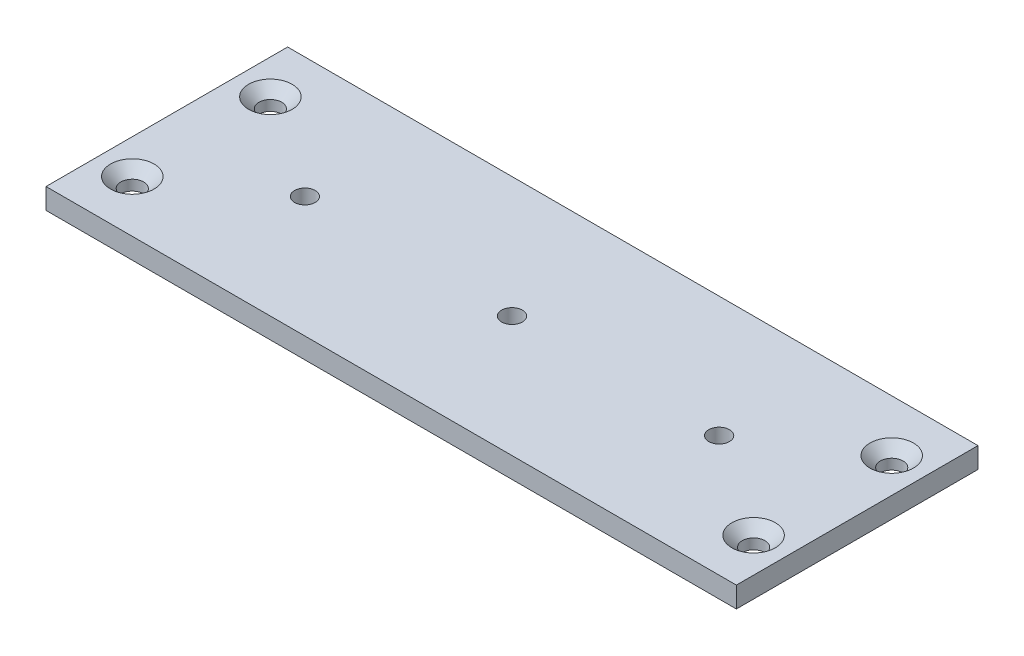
ISO-10303-21;
HEADER;
FILE_DESCRIPTION(('STEP AP214'),'2;1');
FILE_NAME('part.step','',(''),(''),'','','');
FILE_SCHEMA(('AUTOMOTIVE_DESIGN { 1 0 10303 214 1 1 1 1 }'));
ENDSEC;
DATA;
#1=APPLICATION_CONTEXT('core data for automotive mechanical design processes');
#2=APPLICATION_PROTOCOL_DEFINITION('international standard','automotive_design',2000,#1);
#3=PRODUCT_CONTEXT('',#1,'mechanical');
#4=PRODUCT('Part','Part','',(#3));
#5=PRODUCT_RELATED_PRODUCT_CATEGORY('part','',(#4));
#6=PRODUCT_DEFINITION_FORMATION('','',#4);
#7=PRODUCT_DEFINITION_CONTEXT('part definition',#1,'design');
#8=PRODUCT_DEFINITION('design','',#6,#7);
#9=PRODUCT_DEFINITION_SHAPE('','',#8);
#10=(LENGTH_UNIT() NAMED_UNIT(*) SI_UNIT(.MILLI.,.METRE.));
#11=(NAMED_UNIT(*) PLANE_ANGLE_UNIT() SI_UNIT($,.RADIAN.));
#12=(NAMED_UNIT(*) SI_UNIT($,.STERADIAN.) SOLID_ANGLE_UNIT());
#13=UNCERTAINTY_MEASURE_WITH_UNIT(LENGTH_MEASURE(1.E-05),#10,'distance_accuracy_value','');
#14=(GEOMETRIC_REPRESENTATION_CONTEXT(3) GLOBAL_UNCERTAINTY_ASSIGNED_CONTEXT((#13)) GLOBAL_UNIT_ASSIGNED_CONTEXT((#10,
#11,#12)) REPRESENTATION_CONTEXT('',''));
#15=CARTESIAN_POINT('',(0.,0.,0.));
#16=DIRECTION('',(0.,0.,1.));
#17=DIRECTION('',(1.,0.,0.));
#18=AXIS2_PLACEMENT_3D('',#15,#16,#17);
#19=CARTESIAN_POINT('',(0.,0.,-70.));
#20=DIRECTION('',(0.,-1.,0.));
#21=DIRECTION('',(0.,0.,-1.));
#22=AXIS2_PLACEMENT_3D('',#19,#20,#21);
#23=PLANE('',#22);
#24=CARTESIAN_POINT('',(10.,0.,-15.));
#25=DIRECTION('',(0.,1.,0.));
#26=DIRECTION('',(0.,0.,1.));
#27=AXIS2_PLACEMENT_3D('',#24,#25,#26);
#28=CIRCLE('',#27,3.3);
#29=CARTESIAN_POINT('',(10.,0.,-11.7));
#30=VERTEX_POINT('',#29);
#31=EDGE_CURVE('E143',#30,#30,#28,.T.);
#32=ORIENTED_EDGE('',*,*,#31,.T.);
#33=EDGE_LOOP('',(#32));
#34=FACE_BOUND('',#33,.T.);
#35=DIRECTION('',(0.,0.,1.));
#36=VECTOR('',#35,1.);
#37=CARTESIAN_POINT('',(0.,0.,0.));
#38=LINE('',#37,#36);
#39=CARTESIAN_POINT('',(0.,0.,-70.));
#40=VERTEX_POINT('',#39);
#41=CARTESIAN_POINT('',(0.,0.,0.));
#42=VERTEX_POINT('',#41);
#43=EDGE_CURVE('E94',#40,#42,#38,.T.);
#44=ORIENTED_EDGE('',*,*,#43,.F.);
#45=DIRECTION('',(-1.,0.,0.));
#46=VECTOR('',#45,1.);
#47=CARTESIAN_POINT('',(0.,0.,-70.));
#48=LINE('',#47,#46);
#49=CARTESIAN_POINT('',(200.,0.,-70.));
#50=VERTEX_POINT('',#49);
#51=EDGE_CURVE('E70',#50,#40,#48,.T.);
#52=ORIENTED_EDGE('',*,*,#51,.F.);
#53=DIRECTION('',(0.,0.,-1.));
#54=VECTOR('',#53,1.);
#55=CARTESIAN_POINT('',(200.,0.,0.));
#56=LINE('',#55,#54);
#57=CARTESIAN_POINT('',(200.,0.,0.));
#58=VERTEX_POINT('',#57);
#59=EDGE_CURVE('E64',#58,#50,#56,.T.);
#60=ORIENTED_EDGE('',*,*,#59,.F.);
#61=DIRECTION('',(1.,0.,0.));
#62=VECTOR('',#61,1.);
#63=CARTESIAN_POINT('',(0.,0.,0.));
#64=LINE('',#63,#62);
#65=EDGE_CURVE('E86',#42,#58,#64,.T.);
#66=ORIENTED_EDGE('',*,*,#65,.F.);
#67=EDGE_LOOP('',(#44,#52,#60,#66));
#68=FACE_BOUND('',#67,.T.);
#69=CARTESIAN_POINT('',(100.,0.,-35.));
#70=DIRECTION('',(0.,1.,0.));
#71=DIRECTION('',(0.,0.,1.));
#72=AXIS2_PLACEMENT_3D('',#69,#70,#71);
#73=CIRCLE('',#72,3.00000000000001);
#74=CARTESIAN_POINT('',(100.,0.,-32.));
#75=VERTEX_POINT('',#74);
#76=EDGE_CURVE('E97',#75,#75,#73,.T.);
#77=ORIENTED_EDGE('',*,*,#76,.T.);
#78=EDGE_LOOP('',(#77));
#79=FACE_BOUND('',#78,.T.);
#80=CARTESIAN_POINT('',(40.,0.,-35.));
#81=DIRECTION('',(0.,1.,0.));
#82=DIRECTION('',(0.,0.,1.));
#83=AXIS2_PLACEMENT_3D('',#80,#81,#82);
#84=CIRCLE('',#83,3.);
#85=CARTESIAN_POINT('',(40.,0.,-32.));
#86=VERTEX_POINT('',#85);
#87=EDGE_CURVE('E111',#86,#86,#84,.T.);
#88=ORIENTED_EDGE('',*,*,#87,.T.);
#89=EDGE_LOOP('',(#88));
#90=FACE_BOUND('',#89,.T.);
#91=CARTESIAN_POINT('',(160.,0.,-35.));
#92=DIRECTION('',(0.,1.,0.));
#93=DIRECTION('',(0.,0.,1.));
#94=AXIS2_PLACEMENT_3D('',#91,#92,#93);
#95=CIRCLE('',#94,2.99999999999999);
#96=CARTESIAN_POINT('',(160.,0.,-32.));
#97=VERTEX_POINT('',#96);
#98=EDGE_CURVE('E117',#97,#97,#95,.T.);
#99=ORIENTED_EDGE('',*,*,#98,.T.);
#100=EDGE_LOOP('',(#99));
#101=FACE_BOUND('',#100,.T.);
#102=CARTESIAN_POINT('',(190.,0.,-15.));
#103=DIRECTION('',(0.,1.,0.));
#104=DIRECTION('',(0.,0.,1.));
#105=AXIS2_PLACEMENT_3D('',#102,#103,#104);
#106=CIRCLE('',#105,3.3);
#107=CARTESIAN_POINT('',(190.,0.,-11.7));
#108=VERTEX_POINT('',#107);
#109=EDGE_CURVE('E123',#108,#108,#106,.T.);
#110=ORIENTED_EDGE('',*,*,#109,.T.);
#111=EDGE_LOOP('',(#110));
#112=FACE_BOUND('',#111,.T.);
#113=CARTESIAN_POINT('',(190.,0.,-55.));
#114=DIRECTION('',(0.,1.,0.));
#115=DIRECTION('',(0.,0.,1.));
#116=AXIS2_PLACEMENT_3D('',#113,#114,#115);
#117=CIRCLE('',#116,3.3);
#118=CARTESIAN_POINT('',(190.,0.,-51.7));
#119=VERTEX_POINT('',#118);
#120=EDGE_CURVE('E134',#119,#119,#117,.T.);
#121=ORIENTED_EDGE('',*,*,#120,.T.);
#122=EDGE_LOOP('',(#121));
#123=FACE_BOUND('',#122,.T.);
#124=CARTESIAN_POINT('',(10.,0.,-55.));
#125=DIRECTION('',(0.,1.,0.));
#126=DIRECTION('',(0.,0.,1.));
#127=AXIS2_PLACEMENT_3D('',#124,#125,#126);
#128=CIRCLE('',#127,3.3);
#129=CARTESIAN_POINT('',(10.,0.,-51.7));
#130=VERTEX_POINT('',#129);
#131=EDGE_CURVE('E152',#130,#130,#128,.T.);
#132=ORIENTED_EDGE('',*,*,#131,.T.);
#133=EDGE_LOOP('',(#132));
#134=FACE_BOUND('',#133,.T.);
#135=ADVANCED_FACE('F30',(#34,#68,#79,#90,#101,#112,#123,#134),#23,.T.);
#136=CARTESIAN_POINT('',(0.,6.,0.));
#137=DIRECTION('',(1.,0.,0.));
#138=DIRECTION('',(0.,0.,-1.));
#139=AXIS2_PLACEMENT_3D('',#136,#137,#138);
#140=PLANE('',#139);
#141=ORIENTED_EDGE('',*,*,#43,.T.);
#142=DIRECTION('',(0.,-1.,0.));
#143=VECTOR('',#142,1.);
#144=CARTESIAN_POINT('',(0.,6.,0.));
#145=LINE('',#144,#143);
#146=CARTESIAN_POINT('',(0.,6.,0.));
#147=VERTEX_POINT('',#146);
#148=EDGE_CURVE('E11',#147,#42,#145,.T.);
#149=ORIENTED_EDGE('',*,*,#148,.F.);
#150=DIRECTION('',(0.,0.,1.));
#151=VECTOR('',#150,1.);
#152=CARTESIAN_POINT('',(0.,6.,0.));
#153=LINE('',#152,#151);
#154=CARTESIAN_POINT('',(0.,6.,-70.));
#155=VERTEX_POINT('',#154);
#156=EDGE_CURVE('E82',#155,#147,#153,.T.);
#157=ORIENTED_EDGE('',*,*,#156,.F.);
#158=DIRECTION('',(0.,-1.,0.));
#159=VECTOR('',#158,1.);
#160=CARTESIAN_POINT('',(0.,6.,-70.));
#161=LINE('',#160,#159);
#162=EDGE_CURVE('E90',#155,#40,#161,.T.);
#163=ORIENTED_EDGE('',*,*,#162,.T.);
#164=EDGE_LOOP('',(#141,#149,#157,#163));
#165=FACE_BOUND('',#164,.T.);
#166=ADVANCED_FACE('F32',(#165),#140,.F.);
#167=CARTESIAN_POINT('',(0.,6.,0.));
#168=DIRECTION('',(0.,0.,-1.));
#169=DIRECTION('',(-1.,0.,0.));
#170=AXIS2_PLACEMENT_3D('',#167,#168,#169);
#171=PLANE('',#170);
#172=ORIENTED_EDGE('',*,*,#65,.T.);
#173=DIRECTION('',(0.,-1.,0.));
#174=VECTOR('',#173,1.);
#175=CARTESIAN_POINT('',(200.,6.,0.));
#176=LINE('',#175,#174);
#177=CARTESIAN_POINT('',(200.,6.,0.));
#178=VERTEX_POINT('',#177);
#179=EDGE_CURVE('E39',#178,#58,#176,.T.);
#180=ORIENTED_EDGE('',*,*,#179,.F.);
#181=DIRECTION('',(1.,0.,0.));
#182=VECTOR('',#181,1.);
#183=CARTESIAN_POINT('',(0.,6.,0.));
#184=LINE('',#183,#182);
#185=EDGE_CURVE('E77',#147,#178,#184,.T.);
#186=ORIENTED_EDGE('',*,*,#185,.F.);
#187=ORIENTED_EDGE('',*,*,#148,.T.);
#188=EDGE_LOOP('',(#172,#180,#186,#187));
#189=FACE_BOUND('',#188,.T.);
#190=ADVANCED_FACE('F85',(#189),#171,.F.);
#191=CARTESIAN_POINT('',(200.,6.,0.));
#192=DIRECTION('',(-1.,0.,0.));
#193=DIRECTION('',(0.,0.,1.));
#194=AXIS2_PLACEMENT_3D('',#191,#192,#193);
#195=PLANE('',#194);
#196=ORIENTED_EDGE('',*,*,#59,.T.);
#197=DIRECTION('',(0.,-1.,0.));
#198=VECTOR('',#197,1.);
#199=CARTESIAN_POINT('',(200.,6.,-70.));
#200=LINE('',#199,#198);
#201=CARTESIAN_POINT('',(200.,6.,-70.));
#202=VERTEX_POINT('',#201);
#203=EDGE_CURVE('E87',#202,#50,#200,.T.);
#204=ORIENTED_EDGE('',*,*,#203,.F.);
#205=DIRECTION('',(0.,0.,-1.));
#206=VECTOR('',#205,1.);
#207=CARTESIAN_POINT('',(200.,6.,0.));
#208=LINE('',#207,#206);
#209=EDGE_CURVE('E80',#178,#202,#208,.T.);
#210=ORIENTED_EDGE('',*,*,#209,.F.);
#211=ORIENTED_EDGE('',*,*,#179,.T.);
#212=EDGE_LOOP('',(#196,#204,#210,#211));
#213=FACE_BOUND('',#212,.T.);
#214=ADVANCED_FACE('F88',(#213),#195,.F.);
#215=CARTESIAN_POINT('',(0.,6.,-70.));
#216=DIRECTION('',(0.,0.,1.));
#217=DIRECTION('',(1.,0.,0.));
#218=AXIS2_PLACEMENT_3D('',#215,#216,#217);
#219=PLANE('',#218);
#220=ORIENTED_EDGE('',*,*,#51,.T.);
#221=ORIENTED_EDGE('',*,*,#162,.F.);
#222=DIRECTION('',(-1.,0.,0.));
#223=VECTOR('',#222,1.);
#224=CARTESIAN_POINT('',(0.,6.,-70.));
#225=LINE('',#224,#223);
#226=EDGE_CURVE('E47',#202,#155,#225,.T.);
#227=ORIENTED_EDGE('',*,*,#226,.F.);
#228=ORIENTED_EDGE('',*,*,#203,.T.);
#229=EDGE_LOOP('',(#220,#221,#227,#228));
#230=FACE_BOUND('',#229,.T.);
#231=ADVANCED_FACE('F102',(#230),#219,.F.);
#232=CARTESIAN_POINT('',(0.,6.,-70.));
#233=DIRECTION('',(0.,-1.,0.));
#234=DIRECTION('',(0.,0.,-1.));
#235=AXIS2_PLACEMENT_3D('',#232,#233,#234);
#236=PLANE('',#235);
#237=CARTESIAN_POINT('',(10.,6.,-55.));
#238=DIRECTION('',(0.,1.,0.));
#239=DIRECTION('',(0.,0.,1.));
#240=AXIS2_PLACEMENT_3D('',#237,#238,#239);
#241=CIRCLE('',#240,6.3);
#242=CARTESIAN_POINT('',(10.,6.,-48.7));
#243=VERTEX_POINT('',#242);
#244=EDGE_CURVE('E158',#243,#243,#241,.T.);
#245=ORIENTED_EDGE('',*,*,#244,.F.);
#246=EDGE_LOOP('',(#245));
#247=FACE_BOUND('',#246,.T.);
#248=CARTESIAN_POINT('',(10.,6.,-15.));
#249=DIRECTION('',(0.,1.,0.));
#250=DIRECTION('',(0.,0.,1.));
#251=AXIS2_PLACEMENT_3D('',#248,#249,#250);
#252=CIRCLE('',#251,6.3);
#253=CARTESIAN_POINT('',(10.,6.,-8.7));
#254=VERTEX_POINT('',#253);
#255=EDGE_CURVE('E149',#254,#254,#252,.T.);
#256=ORIENTED_EDGE('',*,*,#255,.F.);
#257=EDGE_LOOP('',(#256));
#258=FACE_BOUND('',#257,.T.);
#259=CARTESIAN_POINT('',(190.,6.,-55.));
#260=DIRECTION('',(0.,1.,0.));
#261=DIRECTION('',(0.,0.,1.));
#262=AXIS2_PLACEMENT_3D('',#259,#260,#261);
#263=CIRCLE('',#262,6.3);
#264=CARTESIAN_POINT('',(190.,6.,-48.7));
#265=VERTEX_POINT('',#264);
#266=EDGE_CURVE('E140',#265,#265,#263,.T.);
#267=ORIENTED_EDGE('',*,*,#266,.F.);
#268=EDGE_LOOP('',(#267));
#269=FACE_BOUND('',#268,.T.);
#270=CARTESIAN_POINT('',(190.,6.,-15.));
#271=DIRECTION('',(0.,1.,0.));
#272=DIRECTION('',(0.,0.,1.));
#273=AXIS2_PLACEMENT_3D('',#270,#271,#272);
#274=CIRCLE('',#273,6.3);
#275=CARTESIAN_POINT('',(190.,6.,-8.70000000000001));
#276=VERTEX_POINT('',#275);
#277=EDGE_CURVE('E131',#276,#276,#274,.T.);
#278=ORIENTED_EDGE('',*,*,#277,.F.);
#279=EDGE_LOOP('',(#278));
#280=FACE_BOUND('',#279,.T.);
#281=CARTESIAN_POINT('',(160.,6.,-35.));
#282=DIRECTION('',(0.,1.,0.));
#283=DIRECTION('',(0.,0.,1.));
#284=AXIS2_PLACEMENT_3D('',#281,#282,#283);
#285=CIRCLE('',#284,2.99999999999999);
#286=CARTESIAN_POINT('',(160.,6.,-32.));
#287=VERTEX_POINT('',#286);
#288=EDGE_CURVE('E120',#287,#287,#285,.T.);
#289=ORIENTED_EDGE('',*,*,#288,.F.);
#290=EDGE_LOOP('',(#289));
#291=FACE_BOUND('',#290,.T.);
#292=CARTESIAN_POINT('',(40.,6.,-35.));
#293=DIRECTION('',(0.,1.,0.));
#294=DIRECTION('',(0.,0.,1.));
#295=AXIS2_PLACEMENT_3D('',#292,#293,#294);
#296=CIRCLE('',#295,3.);
#297=CARTESIAN_POINT('',(40.,6.,-32.));
#298=VERTEX_POINT('',#297);
#299=EDGE_CURVE('E114',#298,#298,#296,.T.);
#300=ORIENTED_EDGE('',*,*,#299,.F.);
#301=EDGE_LOOP('',(#300));
#302=FACE_BOUND('',#301,.T.);
#303=CARTESIAN_POINT('',(100.,6.,-35.));
#304=DIRECTION('',(0.,1.,0.));
#305=DIRECTION('',(0.,0.,1.));
#306=AXIS2_PLACEMENT_3D('',#303,#304,#305);
#307=CIRCLE('',#306,3.00000000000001);
#308=CARTESIAN_POINT('',(100.,6.,-32.));
#309=VERTEX_POINT('',#308);
#310=EDGE_CURVE('E108',#309,#309,#307,.T.);
#311=ORIENTED_EDGE('',*,*,#310,.F.);
#312=EDGE_LOOP('',(#311));
#313=FACE_BOUND('',#312,.T.);
#314=ORIENTED_EDGE('',*,*,#156,.T.);
#315=ORIENTED_EDGE('',*,*,#185,.T.);
#316=ORIENTED_EDGE('',*,*,#209,.T.);
#317=ORIENTED_EDGE('',*,*,#226,.T.);
#318=EDGE_LOOP('',(#314,#315,#316,#317));
#319=FACE_BOUND('',#318,.T.);
#320=ADVANCED_FACE('F78',(#247,#258,#269,#280,#291,#302,#313,#319),#236,.F.);
#321=CARTESIAN_POINT('',(100.,0.,-35.));
#322=DIRECTION('',(0.,1.,0.));
#323=DIRECTION('',(0.,0.,1.));
#324=AXIS2_PLACEMENT_3D('',#321,#322,#323);
#325=CYLINDRICAL_SURFACE('',#324,3.00000000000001);
#326=ORIENTED_EDGE('',*,*,#76,.F.);
#327=EDGE_LOOP('',(#326));
#328=FACE_BOUND('',#327,.T.);
#329=ORIENTED_EDGE('',*,*,#310,.T.);
#330=EDGE_LOOP('',(#329));
#331=FACE_BOUND('',#330,.T.);
#332=ADVANCED_FACE('F166',(#328,#331),#325,.F.);
#333=CARTESIAN_POINT('',(40.,0.,-35.));
#334=DIRECTION('',(0.,1.,0.));
#335=DIRECTION('',(0.,0.,1.));
#336=AXIS2_PLACEMENT_3D('',#333,#334,#335);
#337=CYLINDRICAL_SURFACE('',#336,3.);
#338=ORIENTED_EDGE('',*,*,#87,.F.);
#339=EDGE_LOOP('',(#338));
#340=FACE_BOUND('',#339,.T.);
#341=ORIENTED_EDGE('',*,*,#299,.T.);
#342=EDGE_LOOP('',(#341));
#343=FACE_BOUND('',#342,.T.);
#344=ADVANCED_FACE('F181',(#340,#343),#337,.F.);
#345=CARTESIAN_POINT('',(160.,0.,-35.));
#346=DIRECTION('',(0.,1.,0.));
#347=DIRECTION('',(0.,0.,1.));
#348=AXIS2_PLACEMENT_3D('',#345,#346,#347);
#349=CYLINDRICAL_SURFACE('',#348,2.99999999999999);
#350=ORIENTED_EDGE('',*,*,#98,.F.);
#351=EDGE_LOOP('',(#350));
#352=FACE_BOUND('',#351,.T.);
#353=ORIENTED_EDGE('',*,*,#288,.T.);
#354=EDGE_LOOP('',(#353));
#355=FACE_BOUND('',#354,.T.);
#356=ADVANCED_FACE('F187',(#352,#355),#349,.F.);
#357=CARTESIAN_POINT('',(190.,6.,-15.));
#358=DIRECTION('',(0.,1.,0.));
#359=DIRECTION('',(0.,0.,1.));
#360=AXIS2_PLACEMENT_3D('',#357,#358,#359);
#361=CYLINDRICAL_SURFACE('',#360,3.3);
#362=ORIENTED_EDGE('',*,*,#109,.F.);
#363=EDGE_LOOP('',(#362));
#364=FACE_BOUND('',#363,.T.);
#365=CARTESIAN_POINT('',(190.,3.,-15.));
#366=DIRECTION('',(0.,1.,0.));
#367=DIRECTION('',(0.,0.,1.));
#368=AXIS2_PLACEMENT_3D('',#365,#366,#367);
#369=CIRCLE('',#368,3.3);
#370=CARTESIAN_POINT('',(190.,3.,-11.7));
#371=VERTEX_POINT('',#370);
#372=EDGE_CURVE('E128',#371,#371,#369,.T.);
#373=ORIENTED_EDGE('',*,*,#372,.T.);
#374=EDGE_LOOP('',(#373));
#375=FACE_BOUND('',#374,.T.);
#376=ADVANCED_FACE('F227',(#364,#375),#361,.F.);
#377=CARTESIAN_POINT('',(190.,6.,-15.));
#378=DIRECTION('',(0.,1.,0.));
#379=DIRECTION('',(0.,0.,1.));
#380=AXIS2_PLACEMENT_3D('',#377,#378,#379);
#381=CONICAL_SURFACE('',#380,6.3,0.785398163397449);
#382=ORIENTED_EDGE('',*,*,#372,.F.);
#383=EDGE_LOOP('',(#382));
#384=FACE_BOUND('',#383,.T.);
#385=ORIENTED_EDGE('',*,*,#277,.T.);
#386=EDGE_LOOP('',(#385));
#387=FACE_BOUND('',#386,.T.);
#388=ADVANCED_FACE('F232',(#384,#387),#381,.F.);
#389=CARTESIAN_POINT('',(190.,6.,-55.));
#390=DIRECTION('',(0.,1.,0.));
#391=DIRECTION('',(0.,0.,1.));
#392=AXIS2_PLACEMENT_3D('',#389,#390,#391);
#393=CYLINDRICAL_SURFACE('',#392,3.3);
#394=ORIENTED_EDGE('',*,*,#120,.F.);
#395=EDGE_LOOP('',(#394));
#396=FACE_BOUND('',#395,.T.);
#397=CARTESIAN_POINT('',(190.,3.,-55.));
#398=DIRECTION('',(0.,1.,0.));
#399=DIRECTION('',(0.,0.,1.));
#400=AXIS2_PLACEMENT_3D('',#397,#398,#399);
#401=CIRCLE('',#400,3.3);
#402=CARTESIAN_POINT('',(190.,3.,-51.7));
#403=VERTEX_POINT('',#402);
#404=EDGE_CURVE('E137',#403,#403,#401,.T.);
#405=ORIENTED_EDGE('',*,*,#404,.T.);
#406=EDGE_LOOP('',(#405));
#407=FACE_BOUND('',#406,.T.);
#408=ADVANCED_FACE('F243',(#396,#407),#393,.F.);
#409=CARTESIAN_POINT('',(190.,6.,-55.));
#410=DIRECTION('',(0.,1.,0.));
#411=DIRECTION('',(0.,0.,1.));
#412=AXIS2_PLACEMENT_3D('',#409,#410,#411);
#413=CONICAL_SURFACE('',#412,6.3,0.785398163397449);
#414=ORIENTED_EDGE('',*,*,#404,.F.);
#415=EDGE_LOOP('',(#414));
#416=FACE_BOUND('',#415,.T.);
#417=ORIENTED_EDGE('',*,*,#266,.T.);
#418=EDGE_LOOP('',(#417));
#419=FACE_BOUND('',#418,.T.);
#420=ADVANCED_FACE('F253',(#416,#419),#413,.F.);
#421=CARTESIAN_POINT('',(10.,6.,-15.));
#422=DIRECTION('',(0.,1.,0.));
#423=DIRECTION('',(0.,0.,1.));
#424=AXIS2_PLACEMENT_3D('',#421,#422,#423);
#425=CYLINDRICAL_SURFACE('',#424,3.3);
#426=ORIENTED_EDGE('',*,*,#31,.F.);
#427=EDGE_LOOP('',(#426));
#428=FACE_BOUND('',#427,.T.);
#429=CARTESIAN_POINT('',(10.,3.,-15.));
#430=DIRECTION('',(0.,1.,0.));
#431=DIRECTION('',(0.,0.,1.));
#432=AXIS2_PLACEMENT_3D('',#429,#430,#431);
#433=CIRCLE('',#432,3.3);
#434=CARTESIAN_POINT('',(10.,3.,-11.7));
#435=VERTEX_POINT('',#434);
#436=EDGE_CURVE('E146',#435,#435,#433,.T.);
#437=ORIENTED_EDGE('',*,*,#436,.T.);
#438=EDGE_LOOP('',(#437));
#439=FACE_BOUND('',#438,.T.);
#440=ADVANCED_FACE('F263',(#428,#439),#425,.F.);
#441=CARTESIAN_POINT('',(10.,6.,-15.));
#442=DIRECTION('',(0.,1.,0.));
#443=DIRECTION('',(0.,0.,1.));
#444=AXIS2_PLACEMENT_3D('',#441,#442,#443);
#445=CONICAL_SURFACE('',#444,6.3,0.785398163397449);
#446=ORIENTED_EDGE('',*,*,#436,.F.);
#447=EDGE_LOOP('',(#446));
#448=FACE_BOUND('',#447,.T.);
#449=ORIENTED_EDGE('',*,*,#255,.T.);
#450=EDGE_LOOP('',(#449));
#451=FACE_BOUND('',#450,.T.);
#452=ADVANCED_FACE('F273',(#448,#451),#445,.F.);
#453=CARTESIAN_POINT('',(10.,6.,-55.));
#454=DIRECTION('',(0.,1.,0.));
#455=DIRECTION('',(0.,0.,1.));
#456=AXIS2_PLACEMENT_3D('',#453,#454,#455);
#457=CYLINDRICAL_SURFACE('',#456,3.3);
#458=ORIENTED_EDGE('',*,*,#131,.F.);
#459=EDGE_LOOP('',(#458));
#460=FACE_BOUND('',#459,.T.);
#461=CARTESIAN_POINT('',(10.,3.,-55.));
#462=DIRECTION('',(0.,1.,0.));
#463=DIRECTION('',(0.,0.,1.));
#464=AXIS2_PLACEMENT_3D('',#461,#462,#463);
#465=CIRCLE('',#464,3.3);
#466=CARTESIAN_POINT('',(10.,3.,-51.7));
#467=VERTEX_POINT('',#466);
#468=EDGE_CURVE('E155',#467,#467,#465,.T.);
#469=ORIENTED_EDGE('',*,*,#468,.T.);
#470=EDGE_LOOP('',(#469));
#471=FACE_BOUND('',#470,.T.);
#472=ADVANCED_FACE('F283',(#460,#471),#457,.F.);
#473=CARTESIAN_POINT('',(10.,6.,-55.));
#474=DIRECTION('',(0.,1.,0.));
#475=DIRECTION('',(0.,0.,1.));
#476=AXIS2_PLACEMENT_3D('',#473,#474,#475);
#477=CONICAL_SURFACE('',#476,6.3,0.785398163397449);
#478=ORIENTED_EDGE('',*,*,#468,.F.);
#479=EDGE_LOOP('',(#478));
#480=FACE_BOUND('',#479,.T.);
#481=ORIENTED_EDGE('',*,*,#244,.T.);
#482=EDGE_LOOP('',(#481));
#483=FACE_BOUND('',#482,.T.);
#484=ADVANCED_FACE('F162',(#480,#483),#477,.F.);
#485=CLOSED_SHELL('',(#135,#166,#190,#214,#231,#320,#332,#344,#356,#376,#388,#408,#420,#440,
#452,#472,#484));
#486=MANIFOLD_SOLID_BREP('B2',#485);
#487=ADVANCED_BREP_SHAPE_REPRESENTATION('',(#18,#486),#14);
#488=SHAPE_DEFINITION_REPRESENTATION(#9,#487);
ENDSEC;
END-ISO-10303-21;
